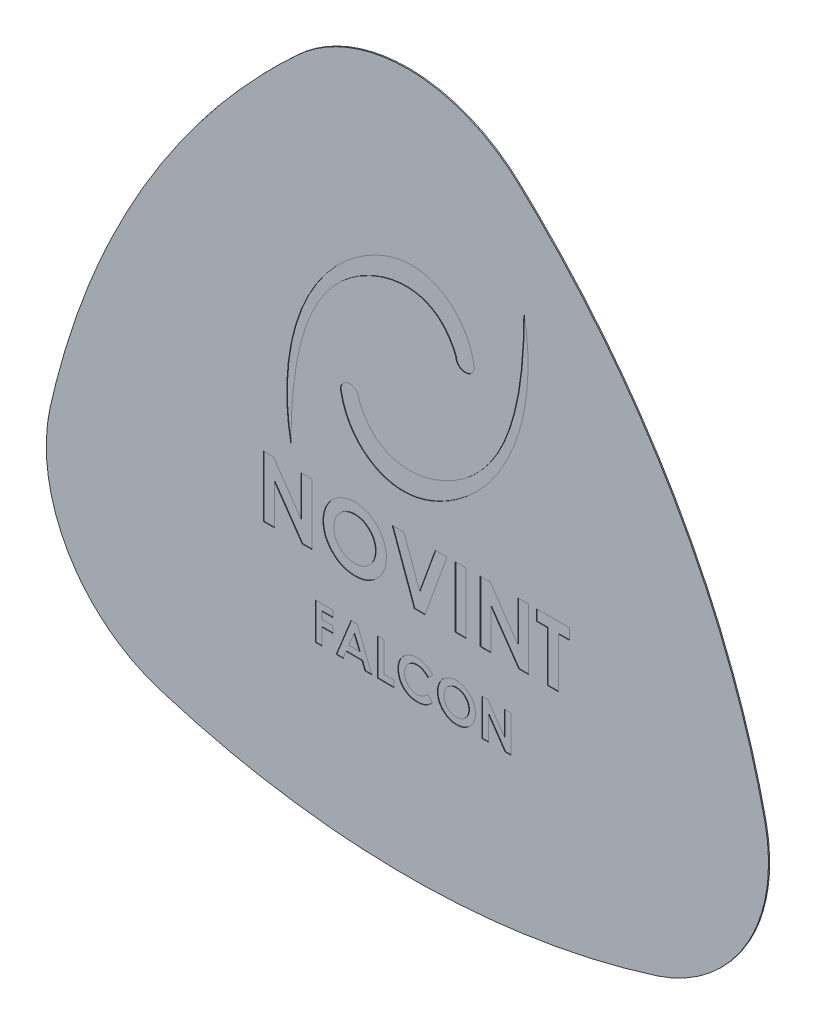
from build123d import *

# Parameters (mm, degrees)
BOSS_EXTRU_1_DEPTH      = 0.1
ESQUISSE2_W             = 0.949786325
ESQUISSE2_H             = 5.291666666
ENL_V_MAT_EXTRU_1_DEPTH = 0.05


with BuildPart() as part:
    # Esquisse1 → Boss.-Extru.1 (new body)
    with BuildSketch(Plane.XY):
        with BuildLine():
            add(Edge.make_bspline(
                [(-1e-09, 149.24999609), (-0.191850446, 149.24999609), (-0.482364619, 149.243335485), (-0.867074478, 149.224895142), (-1.226953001, 149.197576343), (-1.4756996, 149.17264382), (-2.335764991, 149.073184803), (-3.782534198, 148.789769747), (-5.861487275, 148.027713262), (-7.786555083, 146.953586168), (-8.931190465, 146.055192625), (-11.331736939, 143.853967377), (-14.902289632, 140.213201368), (-19.645187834, 134.211789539), (-23.694561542, 127.786555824), (-25.897789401, 123.306060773), (-27.336180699, 119.958079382), (-28.163686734, 117.888667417), (-29.22369016, 114.851682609), (-30.156854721, 111.736774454), (-30.717891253, 109.499484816), (-31.122190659, 107.678790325), (-31.330703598, 106.361173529), (-31.340210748, 104.086200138), (-30.931592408, 101.683245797), (-30.399513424, 100.200966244), (-29.691086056, 98.620921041), (-28.652755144, 96.82672784), (-26.480377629, 94.510099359), (-23.992041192, 92.832431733), (-22.329167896, 92.149511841), (-18.980834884, 91.095060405), (-13.920092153, 89.812269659), (-6.402453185, 88.742298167), (1.048127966, 88.467263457), (5.97213689, 88.793825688), (9.590770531, 89.222132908), (11.796687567, 89.540197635), (14.956796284, 90.140700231), (18.120969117, 90.890010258), (20.339037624, 91.522783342), (22.117955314, 92.082997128), (23.363301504, 92.561228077), (25.338239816, 93.69048138), (27.214950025, 95.245832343), (28.232602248, 96.44776599), (29.246747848, 97.85130469), (30.281399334, 99.64762231), (31.201469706, 102.687270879), (31.410204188, 105.681067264), (31.170193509, 107.462617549), (30.40920889, 110.889584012), (28.989767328, 115.913709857), (26.15757147, 122.95915997), (22.6704695, 129.549068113), (19.925655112, 133.650102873), (17.745414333, 136.569777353), (16.393454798, 138.286363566), (14.353006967, 140.66103418), (12.153490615, 143.002727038), (10.465282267, 144.648478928), (9.002860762, 145.989473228), (8.196777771, 146.647430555), (6.779267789, 147.523256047), (5.532000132, 148.137786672), (4.130695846, 148.655600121), (2.668501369, 149.019742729), (1.260112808, 149.215145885), (0.404132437, 149.24999609), (-1e-09, 149.24999609)],
                knots=[0, 0, 0, 0, 0.00212313, 0.00424626, 0.00636939, 0.00849252, 0.00849252, 0.020144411, 0.031796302, 0.043448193, 0.055100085, 0.055100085, 0.096158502, 0.13721692, 0.178275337, 0.219333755, 0.219333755, 0.238888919, 0.258444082, 0.277999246, 0.29755441, 0.29755441, 0.307312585, 0.31707076, 0.326828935, 0.33658711, 0.33658711, 0.349548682, 0.362510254, 0.375471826, 0.388433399, 0.388433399, 0.42949182, 0.470550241, 0.511608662, 0.552667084, 0.552667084, 0.572222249, 0.591777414, 0.61133258, 0.630887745, 0.630887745, 0.64064592, 0.650404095, 0.66016227, 0.669920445, 0.669920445, 0.682882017, 0.69584359, 0.708805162, 0.721766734, 0.721766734, 0.762825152, 0.803883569, 0.844941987, 0.886000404, 0.886000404, 0.905555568, 0.925110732, 0.944665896, 0.964221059, 0.964221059, 0.973165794, 0.977638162, 0.98211053, 0.986582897, 0.991055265, 0.995527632, 1, 1, 1, 1], degree=3))
        make_face()
    extrude(amount=BOSS_EXTRU_1_DEPTH)

    # Esquisse2 → Enl_v. mat.-Extru.1 (cut)
    # profile 1 of 14: a face of its own
    with BuildSketch(Plane.XY.offset(0.1)):
        with BuildLine():
            ThreePointArc((4.192087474, 129.730182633), (5.001196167, 128.92107394), (5.81030486, 129.730182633))
            add(Edge.make_bspline(
                [(5.81030486, 129.730182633), (5.24876425, 132.874810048), (1.202437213, 135.862486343), (-9.144004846, 131.067571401), (-11.280594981, 122.065551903), (-10.102166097, 115.975334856)],
                knots=[0, 0, 0, 0, 0.231487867, 0.40741182, 1, 1, 1, 1], degree=3))
            add(Edge.make_bspline(
                [(-10.102166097, 115.975334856), (-10.082531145, 120.896953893), (-9.155824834, 131.836487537), (2.42257833, 134.141709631), (4.192087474, 129.730182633)],
                knots=[0, 0, 0, 0, 0.598512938, 1, 1, 1, 1], degree=3))
        make_face()
    # profile 2 of 14: a face of its own
    with BuildSketch(Plane.XY.offset(0.1)):
        with BuildLine():
            ThreePointArc((-4.192087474, 122.269817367), (-5.001196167, 123.07892606), (-5.81030486, 122.269817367))
            add(Edge.make_bspline(
                [(-5.81030486, 122.269817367), (-5.24876425, 119.125189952), (-1.202437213, 116.137513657), (9.144004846, 120.932428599), (11.280594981, 129.934448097), (10.102166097, 136.024665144)],
                knots=[0, 0, 0, 0, 0.231487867, 0.40741182, 1, 1, 1, 1], degree=3))
            add(Edge.make_bspline(
                [(10.102166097, 136.024665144), (10.082531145, 131.103046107), (9.155824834, 120.163512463), (-2.42257833, 117.858290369), (-4.192087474, 122.269817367)],
                knots=[0, 0, 0, 0, 0.598512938, 1, 1, 1, 1], degree=3))
        make_face()
    # profile 3 of 14: a face of its own
    with BuildSketch(Plane.XY.offset(0.1)):
        Polygon((-7.982571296, 105.350933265), (-6.435776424, 105.350933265), (-6.435776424, 104.781061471), (-7.412699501, 104.781061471), (-7.412699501, 104.170484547), (-6.435776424, 104.170484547), (-6.435776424, 103.600612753), (-7.412699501, 103.600612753), (-7.412699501, 102.175933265), (-7.982571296, 102.175933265), align=None)
    # profile 4 of 14: a face of its own
    with BuildSketch(Plane.XY.offset(0.1)):
        Polygon((-4.888345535, 105.350933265), (-4.359814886, 105.350933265), (-3.077603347, 102.175933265), (-3.686272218, 102.175933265), (-3.933047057, 102.827215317), (-5.316385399, 102.827215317), (-5.563160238, 102.175933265), (-6.171193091, 102.175933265), align=None)
        Polygon((-4.624398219, 104.499305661), (-5.100139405, 103.397087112), (-4.148657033, 103.397087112), align=None, mode=Mode.SUBTRACT)
    # profile 5 of 14: a face of its own
    with BuildSketch(Plane.XY.offset(0.1)):
        Polygon((-2.609494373, 105.350933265), (-2.039622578, 105.350933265), (-2.039622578, 102.74580506), (-1.144109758, 102.74580506), (-1.144109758, 102.175933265), (-2.609494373, 102.175933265), align=None)
    # profile 6 of 14: a face of its own
    with BuildSketch(Plane.XY.offset(0.1)):
        with BuildLine():
            Line((2.193710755, 104.800141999), (1.775847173, 104.400722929))
            add(Edge.make_bspline(
                [(1.775847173, 104.400722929), (1.74040058, 104.437374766), (1.671162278, 104.508967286), (1.559593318, 104.603749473), (1.443565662, 104.682737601), (1.325336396, 104.7492609), (1.202778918, 104.799590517), (1.077310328, 104.836266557), (0.94812947, 104.858626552), (0.860704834, 104.861184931), (0.81673259, 104.862471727)],
                knots=[0, 0, 0, 0, 1.115251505, 2.178435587, 3.19620269, 4.182487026, 5.141301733, 6.088180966, 7.038406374, 8, 8, 8, 8], degree=3))
            add(Edge.make_bspline(
                [(0.81673259, 104.862471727), (0.780010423, 104.861455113), (0.707543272, 104.859448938), (0.601142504, 104.844741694), (0.499364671, 104.819731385), (0.40186137, 104.785262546), (0.30891951, 104.740661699), (0.220344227, 104.685963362), (0.136353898, 104.62166154), (0.058057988, 104.548088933), (-0.013564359, 104.467705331), (-0.076847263, 104.38193622), (-0.129856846, 104.290978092), (-0.173360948, 104.195752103), (-0.207248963, 104.095817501), (-0.231449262, 103.991241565), (-0.245446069, 103.881899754), (-0.247535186, 103.807570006), (-0.248596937, 103.769793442)],
                knots=[0, 0, 0, 0, 1.035432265, 2.043311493, 3.022114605, 3.98653278, 4.95457646, 5.923598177, 6.917315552, 7.932509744, 8.948865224, 9.949768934, 10.933144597, 11.912367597, 12.897413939, 13.903909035, 14.934704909, 16, 16, 16, 16], degree=3))
            add(Edge.make_bspline(
                [(-0.248596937, 103.769793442), (-0.248290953, 103.743279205), (-0.247687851, 103.691019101), (-0.241085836, 103.613711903), (-0.230455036, 103.538705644), (-0.215069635, 103.466113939), (-0.195830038, 103.39587388), (-0.173257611, 103.327379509), (-0.144940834, 103.261577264), (-0.113508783, 103.197702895), (-0.076953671, 103.137499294), (-0.037540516, 103.080090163), (0.005196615, 103.025756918), (0.051534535, 102.974721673), (0.10212539, 102.927781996), (0.155661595, 102.883526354), (0.213046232, 102.843062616), (0.273087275, 102.805375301), (0.336303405, 102.772636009), (0.40097942, 102.742980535), (0.46809594, 102.718895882), (0.53683578, 102.699481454), (0.606953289, 102.682972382), (0.679134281, 102.67280724), (0.752753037, 102.665109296), (0.802506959, 102.664633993), (0.82754489, 102.664394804)],
                knots=[0, 0, 0, 0, 1.103660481, 2.175337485, 3.227646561, 4.255952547, 5.262355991, 6.258840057, 7.255597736, 8.242457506, 9.22035537, 10.185017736, 11.140346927, 12.096287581, 13.051739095, 14.01125915, 14.986044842, 15.97314143, 16.960198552, 17.947847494, 18.933482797, 19.925264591, 20.920966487, 21.929612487, 22.958107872, 24, 24, 24, 24], degree=3))
            add(Edge.make_bspline(
                [(0.82754489, 102.664394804), (0.870013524, 102.665623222), (0.953453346, 102.668036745), (1.075913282, 102.686910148), (1.192605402, 102.71795583), (1.285841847, 102.754618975), (1.358890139, 102.790824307), (1.414500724, 102.824312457), (1.472006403, 102.861772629), (1.530452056, 102.90461861), (1.590495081, 102.952336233), (1.651075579, 103.005970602), (1.713744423, 103.063755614), (1.754798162, 103.104997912), (1.775847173, 103.126143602)],
                knots=[0, 0, 0, 0, 1.404581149, 2.759636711, 4.088442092, 5.392261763, 6.066678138, 6.783632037, 7.538459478, 8.336747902, 9.180226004, 10.074962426, 11.012997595, 12, 12, 12, 12], degree=3))
            Line((1.775847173, 103.126143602), (2.180990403, 102.700647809))
            add(Edge.make_bspline(
                [(2.180990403, 102.700647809), (2.152511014, 102.673151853), (2.096925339, 102.619485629), (2.013075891, 102.543284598), (1.92933197, 102.4748095), (1.847716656, 102.411574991), (1.766893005, 102.355423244), (1.686869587, 102.30629818), (1.608552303, 102.262957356), (1.53031487, 102.226131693), (1.451670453, 102.19486288), (1.37075459, 102.167942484), (1.287319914, 102.145168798), (1.200856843, 102.126793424), (1.112171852, 102.112058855), (1.020434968, 102.102113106), (0.926227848, 102.09542691), (0.862325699, 102.0948261), (0.83008896, 102.094523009)],
                knots=[0, 0, 0, 0, 1.244526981, 2.429050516, 3.560637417, 4.644440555, 5.67424972, 6.652764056, 7.595344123, 8.486817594, 9.369275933, 10.254498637, 11.166417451, 12.086725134, 13.032340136, 13.991389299, 14.986715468, 16, 16, 16, 16], degree=3))
            add(Edge.make_bspline(
                [(0.83008896, 102.094523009), (0.770874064, 102.096032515), (0.655006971, 102.098986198), (0.485206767, 102.120870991), (0.323901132, 102.157560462), (0.170697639, 102.209449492), (0.025645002, 102.275735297), (-0.111219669, 102.356998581), (-0.239675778, 102.453023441), (-0.358685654, 102.562684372), (-0.466335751, 102.683795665), (-0.56148597, 102.813835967), (-0.640194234, 102.953444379), (-0.705547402, 103.10055844), (-0.75665272, 103.255849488), (-0.7926222, 103.419485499), (-0.814804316, 103.591308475), (-0.817231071, 103.708667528), (-0.818468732, 103.768521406)],
                knots=[0, 0, 0, 0, 1.078019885, 2.10938526, 3.111377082, 4.085535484, 5.04941344, 6.010039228, 6.978205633, 7.964457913, 8.951525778, 9.924444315, 10.892603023, 11.863865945, 12.85144698, 13.863884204, 14.910567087, 16, 16, 16, 16], degree=3))
            add(Edge.make_bspline(
                [(-0.818468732, 103.768521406), (-0.817945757, 103.807557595), (-0.816909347, 103.884917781), (-0.806016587, 103.998875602), (-0.790831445, 104.109964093), (-0.766741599, 104.217029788), (-0.737703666, 104.321515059), (-0.70159118, 104.422284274), (-0.65846182, 104.519627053), (-0.609705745, 104.613706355), (-0.554548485, 104.703905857), (-0.49293177, 104.789450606), (-0.426441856, 104.87100099), (-0.353481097, 104.947475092), (-0.275109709, 105.01954437), (-0.190973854, 105.086818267), (-0.101579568, 105.150261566), (-0.006684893, 105.208238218), (0.09186662, 105.260681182), (0.192831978, 105.306938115), (0.295963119, 105.34559826), (0.400823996, 105.377665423), (0.507857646, 105.401601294), (0.616300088, 105.419719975), (0.727074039, 105.429848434), (0.80144915, 105.431506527), (0.838993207, 105.432343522)],
                knots=[0, 0, 0, 0, 1.071919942, 2.124283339, 3.142214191, 4.149696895, 5.136002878, 6.119640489, 7.086990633, 8.058538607, 9.028339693, 9.988281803, 10.952401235, 11.916291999, 12.888973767, 13.874849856, 14.873389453, 15.898127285, 16.927174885, 17.938320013, 18.946391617, 19.950418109, 20.947802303, 21.956882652, 22.968648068, 24, 24, 24, 24], degree=3))
            add(Edge.make_bspline(
                [(0.838993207, 105.432343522), (0.871022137, 105.431863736), (0.934746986, 105.430909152), (1.02964398, 105.422951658), (1.123782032, 105.410454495), (1.216824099, 105.391598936), (1.309435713, 105.369215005), (1.400399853, 105.339906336), (1.491151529, 105.3072363), (1.580267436, 105.268185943), (1.667871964, 105.225558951), (1.751912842, 105.177197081), (1.833801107, 105.126076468), (1.911722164, 105.06917157), (1.987135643, 105.008546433), (2.059647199, 104.943918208), (2.128620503, 104.874209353), (2.171904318, 104.824955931), (2.193710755, 104.800141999)],
                knots=[0, 0, 0, 0, 0.996412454, 1.982464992, 2.961075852, 3.949442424, 4.934965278, 5.923860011, 6.921385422, 7.934793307, 8.949617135, 9.951082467, 10.950285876, 11.951772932, 12.951063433, 13.960125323, 14.972308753, 16, 16, 16, 16], degree=3))
        make_face()
    # profile 7 of 14: a face of its own
    with BuildSketch(Plane.XY.offset(0.1)):
        with BuildLine():
            add(Edge.make_bspline(
                [(4.255679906, 105.432343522), (4.310881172, 105.430914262), (4.419860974, 105.42809258), (4.580130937, 105.404571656), (4.734580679, 105.366247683), (4.88314036, 105.312974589), (5.025438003, 105.243309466), (5.16197554, 105.159227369), (5.292263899, 105.059141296), (5.41496799, 104.945386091), (5.5283687, 104.821682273), (5.626630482, 104.688493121), (5.710424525, 104.549269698), (5.779873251, 104.403638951), (5.832771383, 104.250592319), (5.86989219, 104.090910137), (5.89374047, 103.924637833), (5.896483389, 103.811429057), (5.897877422, 103.753893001)],
                knots=[0, 0, 0, 0, 1.014329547, 2.002516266, 2.970391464, 3.935626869, 4.897733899, 5.877609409, 6.878433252, 7.912639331, 8.949961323, 9.958554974, 10.949718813, 11.932905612, 12.9188844, 13.919928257, 14.942845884, 16, 16, 16, 16], degree=3))
            add(Edge.make_bspline(
                [(5.897877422, 103.753893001), (5.896392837, 103.697005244), (5.893467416, 103.584906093), (5.870865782, 103.420166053), (5.833119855, 103.2621944), (5.781118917, 103.110633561), (5.712929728, 102.966217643), (5.63076976, 102.828024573), (5.532470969, 102.697336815), (5.421618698, 102.5742245), (5.299579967, 102.462473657), (5.170321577, 102.36399342), (5.034440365, 102.280544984), (4.892135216, 102.212166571), (4.743100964, 102.159100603), (4.587705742, 102.121658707), (4.425959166, 102.098904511), (4.31596365, 102.095998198), (4.260132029, 102.094523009)],
                knots=[0, 0, 0, 0, 1.051557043, 2.072126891, 3.067553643, 4.050577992, 5.02905126, 6.015227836, 7.017913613, 8.04756643, 9.074058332, 10.072836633, 11.047628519, 12.017157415, 12.98668631, 13.966869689, 14.968021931, 16, 16, 16, 16], degree=3))
            add(Edge.make_bspline(
                [(4.260132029, 102.094523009), (4.201738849, 102.095846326), (4.08700423, 102.098446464), (3.919089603, 102.123172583), (3.758212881, 102.160418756), (3.605725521, 102.216006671), (3.460074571, 102.285496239), (3.322330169, 102.371076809), (3.192538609, 102.472606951), (3.071444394, 102.587486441), (2.961732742, 102.7131898), (2.864890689, 102.845984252), (2.783202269, 102.984855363), (2.716664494, 103.129868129), (2.664208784, 103.28012133), (2.627207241, 103.436530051), (2.605349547, 103.598719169), (2.602304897, 103.708881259), (2.600762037, 103.764705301)],
                knots=[0, 0, 0, 0, 1.067978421, 2.098431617, 3.099715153, 4.085208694, 5.062210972, 6.048429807, 7.046490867, 8.072918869, 9.098532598, 10.095778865, 11.076610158, 12.041847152, 13.011192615, 13.984257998, 14.978533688, 16, 16, 16, 16], degree=3))
            add(Edge.make_bspline(
                [(2.600762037, 103.764705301), (2.601246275, 103.802260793), (2.602208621, 103.876896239), (2.61380108, 103.987502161), (2.630490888, 104.095949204), (2.655174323, 104.201804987), (2.685158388, 104.305816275), (2.724006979, 104.407014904), (2.76822719, 104.506481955), (2.819894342, 104.603042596), (2.877343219, 104.695808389), (2.940025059, 104.784341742), (3.008097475, 104.867572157), (3.081341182, 104.946046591), (3.160008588, 105.019249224), (3.243064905, 105.088216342), (3.332120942, 105.151115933), (3.425227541, 105.209484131), (3.521859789, 105.26226548), (3.621624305, 105.307191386), (3.722465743, 105.346424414), (3.825731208, 105.377388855), (3.930314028, 105.402609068), (4.037331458, 105.419287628), (4.145816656, 105.430879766), (4.218971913, 105.431854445), (4.255679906, 105.432343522)],
                knots=[0, 0, 0, 0, 1.034744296, 2.056386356, 3.06226378, 4.057406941, 5.050368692, 6.043467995, 7.042652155, 8.049140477, 9.059438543, 10.048523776, 11.036952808, 12.020949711, 13.004946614, 13.997082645, 14.994316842, 16.007702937, 17.024872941, 18.026463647, 19.021641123, 20.005082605, 20.995858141, 21.984425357, 22.988620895, 24, 24, 24, 24], degree=3))
        make_face()
        with BuildLine():
            add(Edge.make_bspline(
                [(4.246775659, 104.862471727), (4.209625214, 104.861474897), (4.136305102, 104.859507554), (4.028757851, 104.844519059), (3.925508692, 104.82058073), (3.827129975, 104.785906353), (3.73319532, 104.74177467), (3.643538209, 104.688339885), (3.559400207, 104.623765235), (3.479659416, 104.551517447), (3.407626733, 104.471016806), (3.343983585, 104.38474668), (3.290724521, 104.292851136), (3.246119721, 104.196183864), (3.212542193, 104.093657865), (3.188625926, 103.986076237), (3.173511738, 103.873253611), (3.171606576, 103.796342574), (3.170633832, 103.757073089)],
                knots=[0, 0, 0, 0, 1.033739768, 2.040188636, 3.016340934, 3.979330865, 4.937572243, 5.900995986, 6.878200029, 7.884839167, 8.891893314, 9.879764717, 10.863503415, 11.843163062, 12.837761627, 13.859916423, 14.907309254, 16, 16, 16, 16], degree=3))
            add(Edge.make_bspline(
                [(3.170633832, 103.757073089), (3.171923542, 103.713553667), (3.174451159, 103.62826281), (3.192235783, 103.503842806), (3.222663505, 103.38634046), (3.266600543, 103.27633046), (3.321093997, 103.172591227), (3.388766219, 103.076394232), (3.468521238, 102.987163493), (3.529963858, 102.935066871), (3.561148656, 102.908625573)],
                knots=[0, 0, 0, 0, 1.078454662, 2.113592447, 3.107694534, 4.079536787, 5.043276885, 6.005368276, 6.987637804, 8, 8, 8, 8], degree=3))
            add(Edge.make_bspline(
                [(3.561148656, 102.908625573), (3.586694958, 102.889091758), (3.637212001, 102.850464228), (3.7178482, 102.800955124), (3.800887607, 102.758520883), (3.886956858, 102.724234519), (3.975874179, 102.697265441), (4.067627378, 102.678379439), (4.162086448, 102.666526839), (4.225964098, 102.665110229), (4.258223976, 102.664394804)],
                knots=[0, 0, 0, 0, 1.023928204, 2.024787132, 3.009472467, 3.9914905, 4.972207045, 5.96565515, 6.972602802, 8, 8, 8, 8], degree=3))
            add(Edge.make_bspline(
                [(4.258223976, 102.664394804), (4.294735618, 102.665400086), (4.366573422, 102.667378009), (4.472118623, 102.682181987), (4.573234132, 102.707235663), (4.670547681, 102.741605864), (4.763778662, 102.786291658), (4.85247143, 102.841383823), (4.936781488, 102.906205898), (5.01642069, 102.979402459), (5.089214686, 103.060220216), (5.152725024, 103.146950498), (5.20767746, 103.237682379), (5.251354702, 103.333700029), (5.286258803, 103.434097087), (5.309887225, 103.539318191), (5.325129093, 103.648929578), (5.327034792, 103.723524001), (5.328005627, 103.761525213)],
                knots=[0, 0, 0, 0, 1.026359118, 2.019393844, 2.989460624, 3.950973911, 4.916101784, 5.890408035, 6.881132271, 7.902007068, 8.92769091, 9.933912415, 10.920395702, 11.90457117, 12.894218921, 13.903490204, 14.931958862, 16, 16, 16, 16], degree=3))
            add(Edge.make_bspline(
                [(5.328005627, 103.761525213), (5.327001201, 103.799307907), (5.325024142, 103.873677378), (5.310194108, 103.983006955), (5.285299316, 104.087763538), (5.250825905, 104.188118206), (5.206805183, 104.284169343), (5.152369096, 104.375579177), (5.087708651, 104.462259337), (5.014312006, 104.54361913), (4.934424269, 104.618383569), (4.8486568, 104.683265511), (4.759409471, 104.739645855), (4.664634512, 104.783811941), (4.566270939, 104.818998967), (4.463718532, 104.844911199), (4.356588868, 104.859402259), (4.283706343, 104.861439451), (4.246775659, 104.862471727)],
                knots=[0, 0, 0, 0, 1.055025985, 2.07665775, 3.074803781, 4.057872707, 5.035505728, 6.020516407, 7.023567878, 8.050795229, 9.077271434, 10.074415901, 11.050397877, 12.019801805, 12.988065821, 13.964604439, 14.968634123, 16, 16, 16, 16], degree=3))
        make_face(mode=Mode.SUBTRACT)
    # profile 8 of 14: a face of its own
    with BuildSketch(Plane.XY.offset(0.1)):
        Polygon((6.467749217, 105.350933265), (6.981015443, 105.350933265), (8.421595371, 103.261615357), (8.421595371, 105.350933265), (8.991467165, 105.350933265), (8.991467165, 102.175933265), (8.474384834, 102.175933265), (7.037621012, 104.258890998), (7.037621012, 102.175933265), (6.467749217, 102.175933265), align=None)
    # profile 9 of 14: a face of its own
    with BuildSketch(Plane.XY.offset(0.1)):
        Polygon((-12.474125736, 114.287130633), (-11.618682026, 114.287130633), (-9.21771548, 110.804934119), (-9.21771548, 114.287130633), (-8.267929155, 114.287130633), (-8.267929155, 108.995463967), (-9.129733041, 108.995463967), (-11.524339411, 112.467060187), (-11.524339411, 108.995463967), (-12.474125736, 108.995463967), align=None)
    # profile 10 of 14: a face of its own
    with BuildSketch(Plane.XY.offset(0.1)):
        with BuildLine():
            add(Edge.make_bspline(
                [(-4.559946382, 114.422814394), (-4.467944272, 114.420432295), (-4.286311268, 114.415729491), (-4.019194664, 114.376527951), (-3.761778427, 114.312654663), (-3.514178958, 114.223866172), (-3.27701622, 114.107757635), (-3.049453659, 113.967620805), (-2.832306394, 113.800810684), (-2.627799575, 113.611218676), (-2.438798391, 113.405045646), (-2.275028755, 113.183063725), (-2.135372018, 112.951024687), (-2.01962414, 112.708306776), (-1.931460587, 112.453229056), (-1.869592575, 112.187092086), (-1.829845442, 111.909971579), (-1.82527391, 111.721290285), (-1.822950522, 111.625396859)],
                knots=[0, 0, 0, 0, 1.014329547, 2.002516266, 2.970391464, 3.935626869, 4.897733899, 5.877609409, 6.878433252, 7.912639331, 8.949961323, 9.958554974, 10.949718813, 11.932905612, 12.9188844, 13.919928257, 14.942845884, 16, 16, 16, 16], degree=3))
            add(Edge.make_bspline(
                [(-1.822950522, 111.625396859), (-1.82542483, 111.53058393), (-1.830300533, 111.343752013), (-1.867969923, 111.06918528), (-1.9308798, 110.805899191), (-2.01754803, 110.553297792), (-2.131196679, 110.312604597), (-2.268129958, 110.082282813), (-2.431961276, 109.864469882), (-2.616715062, 109.659282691), (-2.820112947, 109.473031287), (-3.035543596, 109.308897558), (-3.262012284, 109.16981683), (-3.499187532, 109.05585281), (-3.747577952, 108.96740953), (-4.006569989, 108.90500637), (-4.276147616, 108.867082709), (-4.459473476, 108.862238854), (-4.552526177, 108.859780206)],
                knots=[0, 0, 0, 0, 1.051557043, 2.072126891, 3.067553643, 4.050577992, 5.02905126, 6.015227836, 7.017913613, 8.04756643, 9.074058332, 10.072836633, 11.047628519, 12.017157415, 12.98668631, 13.966869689, 14.968021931, 16, 16, 16, 16], degree=3))
            add(Edge.make_bspline(
                [(-4.552526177, 108.859780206), (-4.649848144, 108.861985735), (-4.841072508, 108.866319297), (-5.12093022, 108.907529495), (-5.38905809, 108.969606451), (-5.64320369, 109.062252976), (-5.885955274, 109.178068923), (-6.115529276, 109.320703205), (-6.331848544, 109.489920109), (-6.533672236, 109.681385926), (-6.716524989, 109.890891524), (-6.87792841, 110.11221561), (-7.014075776, 110.343667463), (-7.124972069, 110.585355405), (-7.212398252, 110.835777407), (-7.27406749, 111.09645861), (-7.310496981, 111.366773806), (-7.315571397, 111.55037729), (-7.31814283, 111.643417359)],
                knots=[0, 0, 0, 0, 1.067978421, 2.098431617, 3.099715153, 4.085208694, 5.062210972, 6.048429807, 7.046490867, 8.072918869, 9.098532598, 10.095778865, 11.076610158, 12.041847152, 13.011192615, 13.984257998, 14.978533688, 16, 16, 16, 16], degree=3))
            add(Edge.make_bspline(
                [(-7.31814283, 111.643417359), (-7.317335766, 111.706009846), (-7.315731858, 111.830402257), (-7.296411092, 112.014745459), (-7.268594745, 112.19549053), (-7.227455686, 112.371916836), (-7.177482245, 112.545268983), (-7.112734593, 112.713933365), (-7.039034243, 112.879711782), (-6.952922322, 113.040646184), (-6.857174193, 113.19525584), (-6.75270446, 113.342811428), (-6.639250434, 113.481528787), (-6.517177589, 113.612319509), (-6.386065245, 113.734323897), (-6.247638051, 113.849269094), (-6.099211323, 113.954101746), (-5.944033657, 114.051382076), (-5.782979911, 114.139350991), (-5.616705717, 114.214227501), (-5.448636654, 114.279615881), (-5.276527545, 114.331223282), (-5.102222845, 114.373256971), (-4.923860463, 114.40105457), (-4.743051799, 114.420374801), (-4.62112637, 114.421999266), (-4.559946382, 114.422814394)],
                knots=[0, 0, 0, 0, 1.034744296, 2.056386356, 3.06226378, 4.057406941, 5.050368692, 6.043467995, 7.042652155, 8.049140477, 9.059438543, 10.048523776, 11.036952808, 12.020949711, 13.004946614, 13.997082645, 14.994316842, 16.007702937, 17.024872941, 18.026463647, 19.021641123, 20.005082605, 20.995858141, 21.984425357, 22.988620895, 24, 24, 24, 24], degree=3))
        make_face()
        with BuildLine():
            add(Edge.make_bspline(
                [(-4.574786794, 113.473028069), (-4.636704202, 113.471366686), (-4.758904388, 113.468087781), (-4.938149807, 113.443106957), (-5.110231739, 113.403209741), (-5.274196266, 113.345419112), (-5.430754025, 113.271866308), (-5.580182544, 113.182808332), (-5.720412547, 113.075183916), (-5.853313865, 112.954770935), (-5.973368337, 112.820603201), (-6.079440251, 112.676819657), (-6.168205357, 112.523660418), (-6.24254669, 112.362548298), (-6.298509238, 112.191671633), (-6.338369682, 112.012368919), (-6.363559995, 111.824331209), (-6.366735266, 111.696146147), (-6.368356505, 111.630697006)],
                knots=[0, 0, 0, 0, 1.033739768, 2.040188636, 3.016340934, 3.979330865, 4.937572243, 5.900995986, 6.878200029, 7.884839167, 8.891893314, 9.879764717, 10.863503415, 11.843163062, 12.837761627, 13.859916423, 14.907309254, 16, 16, 16, 16], degree=3))
            add(Edge.make_bspline(
                [(-6.368356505, 111.630697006), (-6.366206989, 111.558164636), (-6.361994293, 111.416013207), (-6.332353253, 111.208646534), (-6.281640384, 111.012809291), (-6.208411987, 110.829459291), (-6.117589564, 110.656560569), (-6.004802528, 110.496232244), (-5.871877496, 110.347514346), (-5.769473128, 110.260686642), (-5.717498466, 110.216617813)],
                knots=[0, 0, 0, 0, 1.078454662, 2.113592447, 3.107694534, 4.079536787, 5.043276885, 6.005368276, 6.987637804, 8, 8, 8, 8], degree=3))
            add(Edge.make_bspline(
                [(-5.717498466, 110.216617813), (-5.674921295, 110.184061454), (-5.590726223, 110.119682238), (-5.456332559, 110.037167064), (-5.317933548, 109.96644333), (-5.174484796, 109.909299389), (-5.02628926, 109.864350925), (-4.873367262, 109.832874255), (-4.715935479, 109.813119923), (-4.60947273, 109.810758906), (-4.555706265, 109.809566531)],
                knots=[0, 0, 0, 0, 1.023928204, 2.024787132, 3.009472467, 3.9914905, 4.972207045, 5.96565515, 6.972602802, 8, 8, 8, 8], degree=3))
            add(Edge.make_bspline(
                [(-4.555706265, 109.809566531), (-4.494853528, 109.811242), (-4.375123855, 109.81453854), (-4.199215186, 109.839211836), (-4.030689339, 109.880967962), (-3.868500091, 109.938251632), (-3.713115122, 110.012727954), (-3.565293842, 110.104548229), (-3.424777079, 110.212585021), (-3.292045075, 110.334579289), (-3.170721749, 110.469275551), (-3.064871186, 110.613826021), (-2.973283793, 110.765045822), (-2.900488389, 110.925075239), (-2.842314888, 111.09240367), (-2.802934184, 111.267772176), (-2.77753107, 111.450457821), (-2.774354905, 111.574781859), (-2.772736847, 111.638117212)],
                knots=[0, 0, 0, 0, 1.026359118, 2.019393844, 2.989460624, 3.950973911, 4.916101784, 5.890408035, 6.881132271, 7.902007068, 8.92769091, 9.933912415, 10.920395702, 11.90457117, 12.894218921, 13.903490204, 14.931958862, 16, 16, 16, 16], degree=3))
            add(Edge.make_bspline(
                [(-2.772736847, 111.638117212), (-2.77441089, 111.701088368), (-2.777705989, 111.825037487), (-2.802422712, 112.007253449), (-2.843914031, 112.181847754), (-2.901369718, 112.349105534), (-2.974737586, 112.509190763), (-3.065464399, 112.661540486), (-3.173231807, 112.806007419), (-3.295559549, 112.941607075), (-3.428705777, 113.066214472), (-3.571651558, 113.174351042), (-3.720397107, 113.268318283), (-3.878355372, 113.341928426), (-4.042294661, 113.40057347), (-4.213215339, 113.443760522), (-4.391764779, 113.467912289), (-4.513235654, 113.471307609), (-4.574786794, 113.473028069)],
                knots=[0, 0, 0, 0, 1.055025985, 2.07665775, 3.074803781, 4.057872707, 5.035505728, 6.020516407, 7.023567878, 8.050795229, 9.077271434, 10.074415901, 11.050397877, 12.019801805, 12.988065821, 13.964604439, 14.968634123, 16, 16, 16, 16], degree=3))
        make_face(mode=Mode.SUBTRACT)
    # profile 11 of 14: a face of its own
    with BuildSketch(Plane.XY.offset(0.1)):
        Polygon((-1.31413642, 114.287130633), (-0.299688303, 114.287130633), (1.060329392, 110.528266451), (2.423527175, 114.287130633), (3.434795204, 114.287130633), (1.516142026, 108.995463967), (0.60133667, 108.995463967), align=None)
    # profile 12 of 14: a face of its own
    with BuildSketch(Plane.XY.offset(0.1)):
        with Locations((4.622028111, 111.6412973)):
            Rectangle(ESQUISSE2_W, ESQUISSE2_H)
    # profile 13 of 14: a face of its own
    with BuildSketch(Plane.XY.offset(0.1)):
        Polygon((6.318075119, 114.287130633), (7.173518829, 114.287130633), (9.574485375, 110.804934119), (9.574485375, 114.287130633), (10.5242717, 114.287130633), (10.5242717, 108.995463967), (9.662467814, 108.995463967), (7.267861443, 112.467060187), (7.267861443, 108.995463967), (6.318075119, 108.995463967), align=None)
    # profile 14 of 14: a face of its own
    with BuildSketch(Plane.XY.offset(0.1)):
        Polygon((11.202690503, 114.287130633), (14.052049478, 114.287130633), (14.052049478, 113.337344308), (13.102263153, 113.337344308), (13.102263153, 108.995463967), (12.152476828, 108.995463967), (12.152476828, 113.337344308), (11.202690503, 113.337344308), align=None)
    extrude(amount=-ENL_V_MAT_EXTRU_1_DEPTH, mode=Mode.SUBTRACT)


solid = part.part
